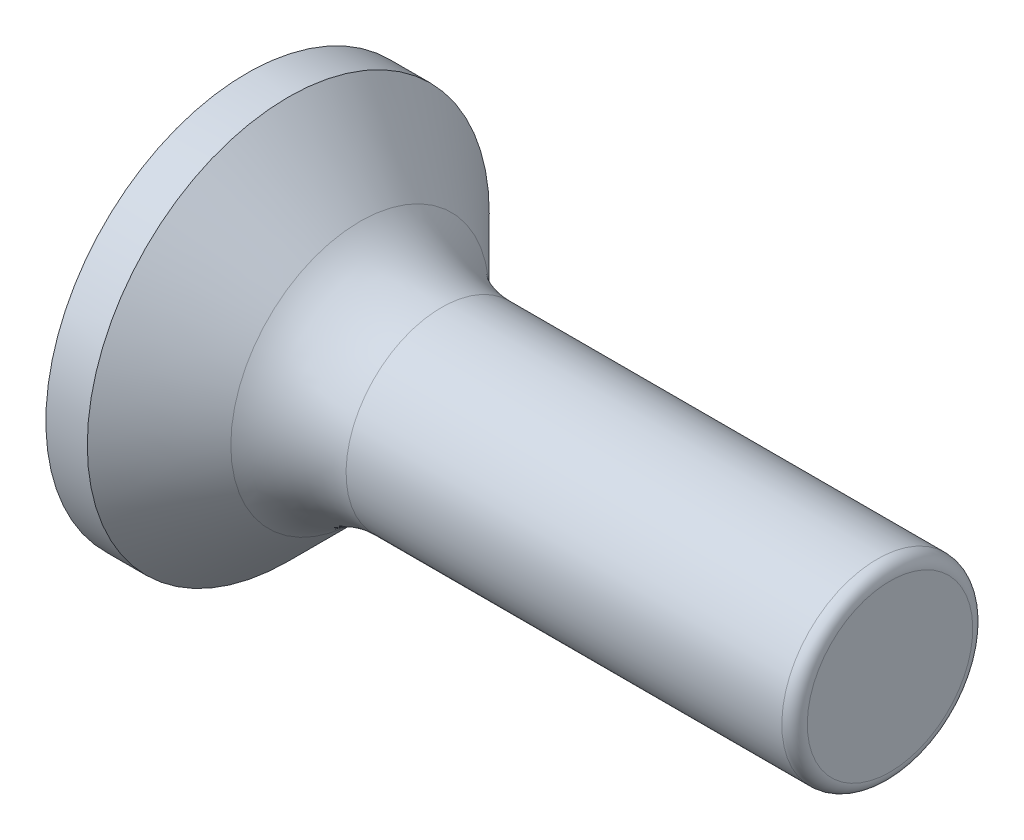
from build123d import *

# Parameters (mm, degrees)
CUT_EXTRUDE1_DEPTH = 2.815266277
DRAFT1_ANGLE       = -45
FILLET2_R          = 0.633333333


with BuildPart() as part:
    # Sketch1 → Base (revolve)
    with BuildSketch(Plane.XY, mode=Mode.PRIVATE) as base_sk:
        with BuildLine():
            Line((34.3, 0), (34.3, 4.75))
            Line((34.3, 4.75), (11.985125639, 4.75))
            ThreePointArc((11.985125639, 4.75), (9.790795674, 5.186479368), (7.930532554, 6.429467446))
            Line((7.930532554, 6.429467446), (4.36, 10))
            Line((4.36, 10), (2.3, 10))
            ThreePointArc((2.3, 10), (0.582409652, 5.13054578), (0, 0))
            Line((0, 0), (34.3, 0))
        make_face()
    revolve(base_sk.sketch.rotate(Axis((-18.093863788, 0, 0), (1, 0, 0)), 180), axis=Axis((-18.093863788, 0, 0), (1, 0, 0)))

    # Sketch2 → Cut-Extrude1 (cut)
    with BuildSketch(Plane(origin=(0, 0, 0), x_dir=(0, 0, -1), z_dir=(1, 0, 0))):
        Polygon((-1.01, 5.05), (1.01, 5.05), (1.01, 1.01), (5.05, 1.01), (5.05, -1.01), (1.01, -1.01), (1.01, -5.05), (-1.01, -5.05), (-1.01, -1.01), (-5.05, -1.01), (-5.05, 1.01), (-1.01, 1.01), align=None)
    extrude(amount=CUT_EXTRUDE1_DEPTH, mode=Mode.SUBTRACT)

    # Draft1
    draft1_faces = [part.faces().sort_by_distance(p)[0] for p in [
        (1.693450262, -5.05, 0),
        (1.693450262, 0, -5.05),
        (1.693450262, 0, 5.05),
        (1.693450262, 5.05, 0),
    ]]
    draft(draft1_faces, Plane(origin=(0, 0, 0), x_dir=(0, 0, 1), z_dir=(1, 0, 0)), DRAFT1_ANGLE)

    # Fillet2
    fillet2_edges = [part.edges().sort_by_distance(p)[0] for p in [
        (34.3, 4.75, 0),
    ]]
    fillet(fillet2_edges, radius=FILLET2_R)


solid = part.part
